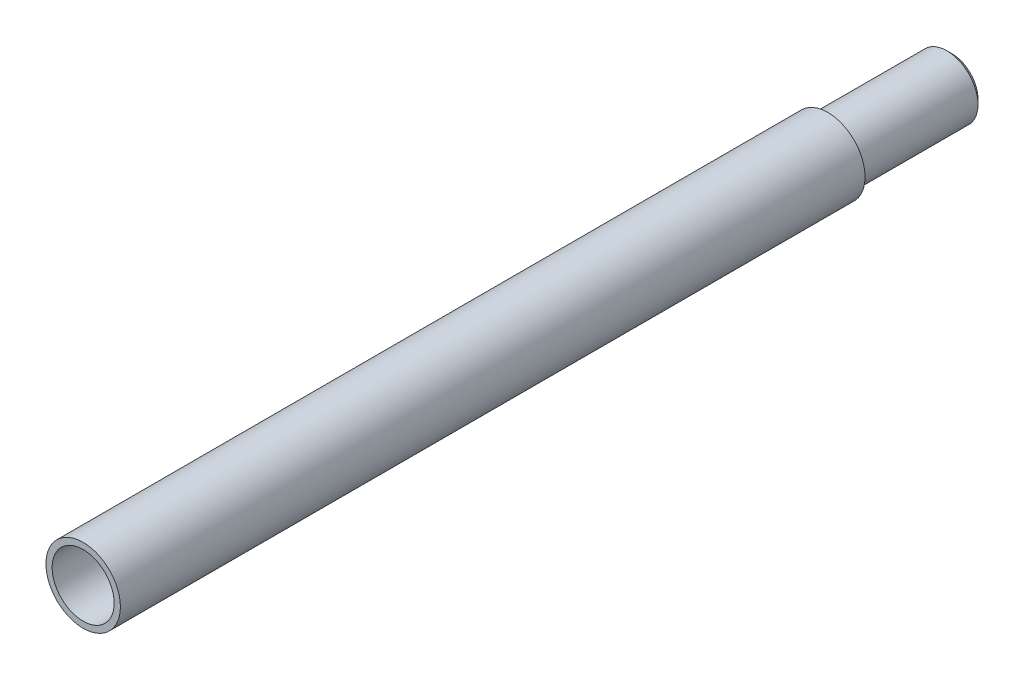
ISO-10303-21;
HEADER;
FILE_DESCRIPTION(('STEP AP214'),'2;1');
FILE_NAME('part.step','',(''),(''),'','','');
FILE_SCHEMA(('AUTOMOTIVE_DESIGN { 1 0 10303 214 1 1 1 1 }'));
ENDSEC;
DATA;
#1=APPLICATION_CONTEXT('core data for automotive mechanical design processes');
#2=APPLICATION_PROTOCOL_DEFINITION('international standard','automotive_design',2000,#1);
#3=PRODUCT_CONTEXT('',#1,'mechanical');
#4=PRODUCT('Part','Part','',(#3));
#5=PRODUCT_RELATED_PRODUCT_CATEGORY('part','',(#4));
#6=PRODUCT_DEFINITION_FORMATION('','',#4);
#7=PRODUCT_DEFINITION_CONTEXT('part definition',#1,'design');
#8=PRODUCT_DEFINITION('design','',#6,#7);
#9=PRODUCT_DEFINITION_SHAPE('','',#8);
#10=(LENGTH_UNIT() NAMED_UNIT(*) SI_UNIT(.MILLI.,.METRE.));
#11=(NAMED_UNIT(*) PLANE_ANGLE_UNIT() SI_UNIT($,.RADIAN.));
#12=(NAMED_UNIT(*) SI_UNIT($,.STERADIAN.) SOLID_ANGLE_UNIT());
#13=UNCERTAINTY_MEASURE_WITH_UNIT(LENGTH_MEASURE(1.E-05),#10,'distance_accuracy_value','');
#14=(GEOMETRIC_REPRESENTATION_CONTEXT(3) GLOBAL_UNCERTAINTY_ASSIGNED_CONTEXT((#13)) GLOBAL_UNIT_ASSIGNED_CONTEXT((#10,
#11,#12)) REPRESENTATION_CONTEXT('',''));
#15=CARTESIAN_POINT('',(0.,0.,0.));
#16=DIRECTION('',(0.,0.,1.));
#17=DIRECTION('',(1.,0.,0.));
#18=AXIS2_PLACEMENT_3D('',#15,#16,#17);
#19=CARTESIAN_POINT('',(0.,0.,0.));
#20=DIRECTION('',(0.,0.,1.));
#21=DIRECTION('',(1.,0.,0.));
#22=AXIS2_PLACEMENT_3D('',#19,#20,#21);
#23=PLANE('',#22);
#24=CARTESIAN_POINT('',(0.,0.,0.));
#25=DIRECTION('',(0.,0.,1.));
#26=DIRECTION('',(1.,0.,0.));
#27=AXIS2_PLACEMENT_3D('',#24,#25,#26);
#28=CIRCLE('',#27,15.);
#29=CARTESIAN_POINT('',(15.,0.,0.));
#30=VERTEX_POINT('',#29);
#31=EDGE_CURVE('E50',#30,#30,#28,.T.);
#32=ORIENTED_EDGE('',*,*,#31,.F.);
#33=EDGE_LOOP('',(#32));
#34=FACE_BOUND('',#33,.T.);
#35=CARTESIAN_POINT('',(0.,0.,0.));
#36=DIRECTION('',(0.,0.,1.));
#37=DIRECTION('',(1.,0.,0.));
#38=AXIS2_PLACEMENT_3D('',#35,#36,#37);
#39=CIRCLE('',#38,12.5005);
#40=CARTESIAN_POINT('',(12.5005,0.,0.));
#41=VERTEX_POINT('',#40);
#42=EDGE_CURVE('E41',#41,#41,#39,.F.);
#43=ORIENTED_EDGE('',*,*,#42,.F.);
#44=EDGE_LOOP('',(#43));
#45=FACE_BOUND('',#44,.T.);
#46=ADVANCED_FACE('F30',(#34,#45),#23,.F.);
#47=CARTESIAN_POINT('',(0.,0.,300.));
#48=DIRECTION('',(0.,0.,1.));
#49=DIRECTION('',(1.,0.,0.));
#50=AXIS2_PLACEMENT_3D('',#47,#48,#49);
#51=PLANE('',#50);
#52=CARTESIAN_POINT('',(0.,0.,300.));
#53=DIRECTION('',(0.,0.,1.));
#54=DIRECTION('',(1.,0.,0.));
#55=AXIS2_PLACEMENT_3D('',#52,#53,#54);
#56=CIRCLE('',#55,15.);
#57=CARTESIAN_POINT('',(15.,0.,300.));
#58=VERTEX_POINT('',#57);
#59=EDGE_CURVE('E45',#58,#58,#56,.T.);
#60=ORIENTED_EDGE('',*,*,#59,.T.);
#61=EDGE_LOOP('',(#60));
#62=FACE_BOUND('',#61,.T.);
#63=CARTESIAN_POINT('',(0.,0.,300.));
#64=DIRECTION('',(0.,0.,1.));
#65=DIRECTION('',(1.,0.,0.));
#66=AXIS2_PLACEMENT_3D('',#63,#64,#65);
#67=CIRCLE('',#66,12.5);
#68=CARTESIAN_POINT('',(12.5,0.,300.));
#69=VERTEX_POINT('',#68);
#70=EDGE_CURVE('E53',#69,#69,#67,.T.);
#71=ORIENTED_EDGE('',*,*,#70,.F.);
#72=EDGE_LOOP('',(#71));
#73=FACE_BOUND('',#72,.T.);
#74=ADVANCED_FACE('F72',(#62,#73),#51,.T.);
#75=CARTESIAN_POINT('',(0.,0.,300.));
#76=DIRECTION('',(0.,0.,-1.));
#77=DIRECTION('',(-1.,0.,0.));
#78=AXIS2_PLACEMENT_3D('',#75,#76,#77);
#79=CYLINDRICAL_SURFACE('',#78,15.);
#80=ORIENTED_EDGE('',*,*,#59,.F.);
#81=EDGE_LOOP('',(#80));
#82=FACE_BOUND('',#81,.T.);
#83=ORIENTED_EDGE('',*,*,#31,.T.);
#84=EDGE_LOOP('',(#83));
#85=FACE_BOUND('',#84,.T.);
#86=ADVANCED_FACE('F32',(#82,#85),#79,.T.);
#87=CARTESIAN_POINT('',(0.,0.,300.));
#88=DIRECTION('',(0.,0.,-1.));
#89=DIRECTION('',(-1.,0.,0.));
#90=AXIS2_PLACEMENT_3D('',#87,#88,#89);
#91=CYLINDRICAL_SURFACE('',#90,12.5);
#92=ORIENTED_EDGE('',*,*,#70,.T.);
#93=EDGE_LOOP('',(#92));
#94=FACE_BOUND('',#93,.T.);
#95=CARTESIAN_POINT('',(0.,0.,0.));
#96=DIRECTION('',(0.,0.,1.));
#97=DIRECTION('',(1.,0.,0.));
#98=AXIS2_PLACEMENT_3D('',#95,#96,#97);
#99=CIRCLE('',#98,12.5);
#100=CARTESIAN_POINT('',(12.5,0.,0.));
#101=VERTEX_POINT('',#100);
#102=EDGE_CURVE('E56',#101,#101,#99,.T.);
#103=ORIENTED_EDGE('',*,*,#102,.F.);
#104=EDGE_LOOP('',(#103));
#105=FACE_BOUND('',#104,.T.);
#106=ADVANCED_FACE('F62',(#94,#105),#91,.F.);
#107=CARTESIAN_POINT('',(0.,0.,0.));
#108=DIRECTION('',(0.,0.,-1.));
#109=DIRECTION('',(-1.,0.,0.));
#110=AXIS2_PLACEMENT_3D('',#107,#108,#109);
#111=PLANE('',#110);
#112=ORIENTED_EDGE('',*,*,#102,.T.);
#113=EDGE_LOOP('',(#112));
#114=FACE_BOUND('',#113,.T.);
#115=ADVANCED_FACE('F60',(#114),#111,.F.);
#116=CARTESIAN_POINT('',(0.,0.,-50.));
#117=DIRECTION('',(0.,0.,1.));
#118=DIRECTION('',(1.,0.,0.));
#119=AXIS2_PLACEMENT_3D('',#116,#117,#118);
#120=CYLINDRICAL_SURFACE('',#119,12.5005);
#121=CARTESIAN_POINT('',(0.,0.,-48.));
#122=DIRECTION('',(0.,0.,-1.));
#123=DIRECTION('',(-1.,0.,0.));
#124=AXIS2_PLACEMENT_3D('',#121,#122,#123);
#125=CIRCLE('',#124,12.5005);
#126=CARTESIAN_POINT('',(-12.5005,0.,-48.));
#127=VERTEX_POINT('',#126);
#128=EDGE_CURVE('E10',#127,#127,#125,.F.);
#129=ORIENTED_EDGE('',*,*,#128,.T.);
#130=EDGE_LOOP('',(#129));
#131=FACE_BOUND('',#130,.T.);
#132=ORIENTED_EDGE('',*,*,#42,.T.);
#133=EDGE_LOOP('',(#132));
#134=FACE_BOUND('',#133,.T.);
#135=ADVANCED_FACE('F70',(#131,#134),#120,.T.);
#136=CARTESIAN_POINT('',(0.,0.,-50.));
#137=DIRECTION('',(0.,0.,-1.));
#138=DIRECTION('',(-1.,0.,0.));
#139=AXIS2_PLACEMENT_3D('',#136,#137,#138);
#140=PLANE('',#139);
#141=CARTESIAN_POINT('',(0.,0.,-50.));
#142=DIRECTION('',(0.,0.,-1.));
#143=DIRECTION('',(-1.,0.,0.));
#144=AXIS2_PLACEMENT_3D('',#141,#142,#143);
#145=CIRCLE('',#144,10.5005);
#146=CARTESIAN_POINT('',(-10.5005,0.,-50.));
#147=VERTEX_POINT('',#146);
#148=EDGE_CURVE('E37',#147,#147,#145,.T.);
#149=ORIENTED_EDGE('',*,*,#148,.T.);
#150=EDGE_LOOP('',(#149));
#151=FACE_BOUND('',#150,.T.);
#152=ADVANCED_FACE('F87',(#151),#140,.T.);
#153=CARTESIAN_POINT('',(0.,0.,-50.));
#154=DIRECTION('',(0.,0.,1.));
#155=DIRECTION('',(1.,0.,0.));
#156=AXIS2_PLACEMENT_3D('',#153,#154,#155);
#157=CONICAL_SURFACE('',#156,10.5005,0.785398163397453);
#158=ORIENTED_EDGE('',*,*,#128,.F.);
#159=EDGE_LOOP('',(#158));
#160=FACE_BOUND('',#159,.T.);
#161=ORIENTED_EDGE('',*,*,#148,.F.);
#162=EDGE_LOOP('',(#161));
#163=FACE_BOUND('',#162,.T.);
#164=ADVANCED_FACE('F91',(#160,#163),#157,.T.);
#165=CLOSED_SHELL('',(#46,#74,#86,#106,#115,#135,#152,#164));
#166=MANIFOLD_SOLID_BREP('B2',#165);
#167=ADVANCED_BREP_SHAPE_REPRESENTATION('',(#18,#166),#14);
#168=SHAPE_DEFINITION_REPRESENTATION(#9,#167);
ENDSEC;
END-ISO-10303-21;
